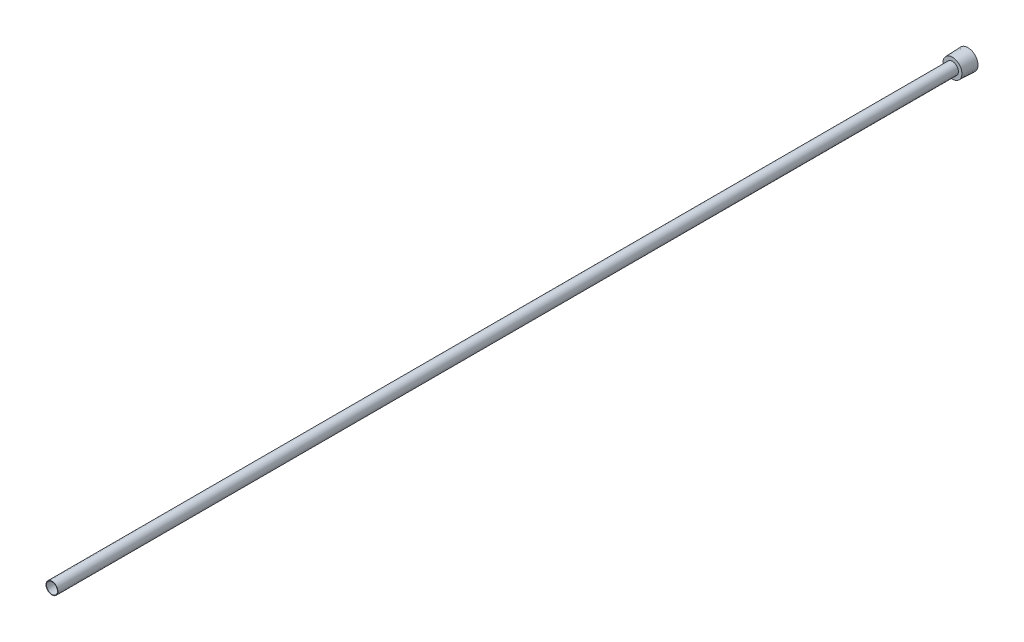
ISO-10303-21;
HEADER;
FILE_DESCRIPTION(('STEP AP214'),'2;1');
FILE_NAME('part.step','',(''),(''),'','','');
FILE_SCHEMA(('AUTOMOTIVE_DESIGN { 1 0 10303 214 1 1 1 1 }'));
ENDSEC;
DATA;
#1=APPLICATION_CONTEXT('core data for automotive mechanical design processes');
#2=APPLICATION_PROTOCOL_DEFINITION('international standard','automotive_design',2000,#1);
#3=PRODUCT_CONTEXT('',#1,'mechanical');
#4=PRODUCT('Part','Part','',(#3));
#5=PRODUCT_RELATED_PRODUCT_CATEGORY('part','',(#4));
#6=PRODUCT_DEFINITION_FORMATION('','',#4);
#7=PRODUCT_DEFINITION_CONTEXT('part definition',#1,'design');
#8=PRODUCT_DEFINITION('design','',#6,#7);
#9=PRODUCT_DEFINITION_SHAPE('','',#8);
#10=(LENGTH_UNIT() NAMED_UNIT(*) SI_UNIT(.MILLI.,.METRE.));
#11=(NAMED_UNIT(*) PLANE_ANGLE_UNIT() SI_UNIT($,.RADIAN.));
#12=(NAMED_UNIT(*) SI_UNIT($,.STERADIAN.) SOLID_ANGLE_UNIT());
#13=UNCERTAINTY_MEASURE_WITH_UNIT(LENGTH_MEASURE(1.E-05),#10,'distance_accuracy_value','');
#14=(GEOMETRIC_REPRESENTATION_CONTEXT(3) GLOBAL_UNCERTAINTY_ASSIGNED_CONTEXT((#13)) GLOBAL_UNIT_ASSIGNED_CONTEXT((#10,
#11,#12)) REPRESENTATION_CONTEXT('',''));
#15=CARTESIAN_POINT('',(0.,0.,0.));
#16=DIRECTION('',(0.,0.,1.));
#17=DIRECTION('',(1.,0.,0.));
#18=AXIS2_PLACEMENT_3D('',#15,#16,#17);
#19=CARTESIAN_POINT('',(0.,0.,0.));
#20=DIRECTION('',(0.,0.,1.));
#21=DIRECTION('',(1.,0.,0.));
#22=AXIS2_PLACEMENT_3D('',#19,#20,#21);
#23=CYLINDRICAL_SURFACE('',#22,3.65125);
#24=CARTESIAN_POINT('',(0.,0.,609.6));
#25=DIRECTION('',(0.,0.,1.));
#26=DIRECTION('',(1.,0.,0.));
#27=AXIS2_PLACEMENT_3D('',#24,#25,#26);
#28=CIRCLE('',#27,3.65125);
#29=CARTESIAN_POINT('',(3.65125,0.,609.6));
#30=VERTEX_POINT('',#29);
#31=EDGE_CURVE('E141',#30,#30,#28,.T.);
#32=CARTESIAN_POINT('',(0.,0.,6.35));
#33=DIRECTION('',(0.,0.,-1.));
#34=DIRECTION('',(-1.,0.,0.));
#35=AXIS2_PLACEMENT_3D('',#32,#33,#34);
#36=CIRCLE('',#35,3.65125);
#37=CARTESIAN_POINT('',(3.65125,0.,6.35));
#38=VERTEX_POINT('',#37);
#39=EDGE_CURVE('E36',#38,#38,#36,.F.);
#40=CARTESIAN_POINT('',(3.65125,0.,609.6));
#41=CARTESIAN_POINT('',(3.65125,0.,603.316145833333));
#42=CARTESIAN_POINT('',(3.65125,0.,597.032291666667));
#43=CARTESIAN_POINT('',(3.65125,0.,584.464583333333));
#44=CARTESIAN_POINT('',(3.65125,0.,578.180729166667));
#45=CARTESIAN_POINT('',(3.65125,0.,565.613020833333));
#46=CARTESIAN_POINT('',(3.65125,0.,559.329166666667));
#47=CARTESIAN_POINT('',(3.65125,0.,546.761458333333));
#48=CARTESIAN_POINT('',(3.65125,0.,540.477604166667));
#49=CARTESIAN_POINT('',(3.65125,0.,527.909895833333));
#50=CARTESIAN_POINT('',(3.65125,0.,521.626041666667));
#51=CARTESIAN_POINT('',(3.65125,0.,509.058333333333));
#52=CARTESIAN_POINT('',(3.65125,0.,502.774479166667));
#53=CARTESIAN_POINT('',(3.65125,0.,490.206770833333));
#54=CARTESIAN_POINT('',(3.65125,0.,483.922916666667));
#55=CARTESIAN_POINT('',(3.65125,0.,471.355208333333));
#56=CARTESIAN_POINT('',(3.65125,0.,465.071354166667));
#57=CARTESIAN_POINT('',(3.65125,0.,452.503645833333));
#58=CARTESIAN_POINT('',(3.65125,0.,446.219791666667));
#59=CARTESIAN_POINT('',(3.65125,0.,433.652083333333));
#60=CARTESIAN_POINT('',(3.65125,0.,427.368229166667));
#61=CARTESIAN_POINT('',(3.65125,0.,414.800520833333));
#62=CARTESIAN_POINT('',(3.65125,0.,408.516666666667));
#63=CARTESIAN_POINT('',(3.65125,0.,395.948958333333));
#64=CARTESIAN_POINT('',(3.65125,0.,389.665104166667));
#65=CARTESIAN_POINT('',(3.65125,0.,377.097395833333));
#66=CARTESIAN_POINT('',(3.65125,0.,370.813541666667));
#67=CARTESIAN_POINT('',(3.65125,0.,358.245833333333));
#68=CARTESIAN_POINT('',(3.65125,0.,351.961979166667));
#69=CARTESIAN_POINT('',(3.65125,0.,339.394270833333));
#70=CARTESIAN_POINT('',(3.65125,0.,333.110416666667));
#71=CARTESIAN_POINT('',(3.65125,0.,320.542708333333));
#72=CARTESIAN_POINT('',(3.65125,0.,314.258854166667));
#73=CARTESIAN_POINT('',(3.65125,0.,301.691145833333));
#74=CARTESIAN_POINT('',(3.65125,0.,295.407291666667));
#75=CARTESIAN_POINT('',(3.65125,0.,282.839583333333));
#76=CARTESIAN_POINT('',(3.65125,0.,276.555729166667));
#77=CARTESIAN_POINT('',(3.65125,0.,263.988020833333));
#78=CARTESIAN_POINT('',(3.65125,0.,257.704166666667));
#79=CARTESIAN_POINT('',(3.65125,0.,245.136458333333));
#80=CARTESIAN_POINT('',(3.65125,0.,238.852604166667));
#81=CARTESIAN_POINT('',(3.65125,0.,226.284895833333));
#82=CARTESIAN_POINT('',(3.65125,0.,220.001041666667));
#83=CARTESIAN_POINT('',(3.65125,0.,207.433333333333));
#84=CARTESIAN_POINT('',(3.65125,0.,201.149479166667));
#85=CARTESIAN_POINT('',(3.65125,0.,188.581770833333));
#86=CARTESIAN_POINT('',(3.65125,0.,182.297916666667));
#87=CARTESIAN_POINT('',(3.65125,0.,169.730208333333));
#88=CARTESIAN_POINT('',(3.65125,0.,163.446354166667));
#89=CARTESIAN_POINT('',(3.65125,0.,150.878645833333));
#90=CARTESIAN_POINT('',(3.65125,0.,144.594791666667));
#91=CARTESIAN_POINT('',(3.65125,0.,132.027083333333));
#92=CARTESIAN_POINT('',(3.65125,0.,125.743229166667));
#93=CARTESIAN_POINT('',(3.65125,0.,113.175520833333));
#94=CARTESIAN_POINT('',(3.65125,0.,106.891666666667));
#95=CARTESIAN_POINT('',(3.65125,0.,94.3239583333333));
#96=CARTESIAN_POINT('',(3.65125,0.,88.0401041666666));
#97=CARTESIAN_POINT('',(3.65125,0.,75.4723958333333));
#98=CARTESIAN_POINT('',(3.65125,0.,69.1885416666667));
#99=CARTESIAN_POINT('',(3.65125,0.,56.6208333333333));
#100=CARTESIAN_POINT('',(3.65125,0.,50.3369791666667));
#101=CARTESIAN_POINT('',(3.65125,0.,37.7692708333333));
#102=CARTESIAN_POINT('',(3.65125,0.,31.4854166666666));
#103=CARTESIAN_POINT('',(3.65125,0.,18.9177083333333));
#104=CARTESIAN_POINT('',(3.65125,0.,12.6338541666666));
#105=CARTESIAN_POINT('',(3.65125,0.,6.34999999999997));
#106=B_SPLINE_CURVE_WITH_KNOTS('',3,(#40,#41,#42,#43,#44,#45,#46,#47,#48,#49,#50,#51,#52,#53,
#54,#55,#56,#57,#58,#59,#60,#61,#62,#63,#64,#65,#66,#67,#68,#69,#70,#71,#72,#73,#74,#75,#76,#77,
#78,#79,#80,#81,#82,#83,#84,#85,#86,#87,#88,#89,#90,#91,#92,#93,#94,#95,#96,#97,#98,#99,#100,
#101,#102,#103,#104,#105),.UNSPECIFIED.,.F.,.F.,(4,2,2,2,2,2,2,2,2,2,2,2,2,2,2,2,2,2,2,2,2,2,2,
2,2,2,2,2,2,2,2,2,4),(0.,18.8515625,37.7031250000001,56.5546875,75.40625,94.2578125,113.109375,
131.9609375,150.8125,169.6640625,188.515625,207.3671875,226.21875,245.0703125,263.921875,
282.7734375,301.625,320.4765625,339.328125,358.1796875,377.03125,395.8828125,414.734375,
433.5859375,452.4375,471.2890625,490.140625,508.9921875,527.84375,546.6953125,565.546875,
584.3984375,603.25),.UNSPECIFIED.);
#107=EDGE_CURVE('BSEAM32',#30,#38,#106,.T.);
#108=ORIENTED_EDGE('',*,*,#31,.T.);
#109=ORIENTED_EDGE('',*,*,#39,.F.);
#110=ORIENTED_EDGE('',*,*,#107,.T.);
#111=ORIENTED_EDGE('',*,*,#107,.F.);
#112=EDGE_LOOP('',(#108,#110,#109,#111));
#113=FACE_BOUND('',#112,.T.);
#114=ADVANCED_FACE('F32',(#113),#23,.F.);
#115=CARTESIAN_POINT('',(0.,0.,0.));
#116=DIRECTION('',(0.,0.,-1.));
#117=DIRECTION('',(-1.,0.,0.));
#118=AXIS2_PLACEMENT_3D('',#115,#116,#117);
#119=CONICAL_SURFACE('',#118,6.7183,0.0364599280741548);
#120=CARTESIAN_POINT('',(0.,0.,10.3124));
#121=DIRECTION('',(0.,0.,1.));
#122=DIRECTION('',(1.,0.,0.));
#123=AXIS2_PLACEMENT_3D('',#120,#121,#122);
#124=CIRCLE('',#123,6.34214394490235);
#125=CARTESIAN_POINT('',(6.34214394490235,0.,10.3124));
#126=VERTEX_POINT('',#125);
#127=EDGE_CURVE('E11',#126,#126,#124,.T.);
#128=ORIENTED_EDGE('',*,*,#127,.F.);
#129=EDGE_LOOP('',(#128));
#130=FACE_BOUND('',#129,.T.);
#131=CARTESIAN_POINT('',(0.,0.,0.));
#132=DIRECTION('',(0.,0.,1.));
#133=DIRECTION('',(1.,0.,0.));
#134=AXIS2_PLACEMENT_3D('',#131,#132,#133);
#135=CIRCLE('',#134,6.7183);
#136=CARTESIAN_POINT('',(6.7183,0.,0.));
#137=VERTEX_POINT('',#136);
#138=EDGE_CURVE('E144',#137,#137,#135,.T.);
#139=ORIENTED_EDGE('',*,*,#138,.T.);
#140=EDGE_LOOP('',(#139));
#141=FACE_BOUND('',#140,.T.);
#142=ADVANCED_FACE('F34',(#130,#141),#119,.T.);
#143=CARTESIAN_POINT('',(0.,6.34214394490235,10.3124));
#144=DIRECTION('',(0.,0.,-1.));
#145=DIRECTION('',(-1.,0.,0.));
#146=AXIS2_PLACEMENT_3D('',#143,#144,#145);
#147=PLANE('',#146);
#148=CARTESIAN_POINT('',(0.,0.,10.3124));
#149=DIRECTION('',(0.,0.,1.));
#150=DIRECTION('',(1.,0.,0.));
#151=AXIS2_PLACEMENT_3D('',#148,#149,#150);
#152=CIRCLE('',#151,3.96875);
#153=CARTESIAN_POINT('',(3.96875,0.,10.3124));
#154=VERTEX_POINT('',#153);
#155=EDGE_CURVE('E41',#154,#154,#152,.T.);
#156=ORIENTED_EDGE('',*,*,#155,.F.);
#157=EDGE_LOOP('',(#156));
#158=FACE_BOUND('',#157,.T.);
#159=ORIENTED_EDGE('',*,*,#127,.T.);
#160=EDGE_LOOP('',(#159));
#161=FACE_BOUND('',#160,.T.);
#162=ADVANCED_FACE('F155',(#158,#161),#147,.F.);
#163=CARTESIAN_POINT('',(0.,0.,331.124179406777));
#164=DIRECTION('',(0.,0.,1.));
#165=DIRECTION('',(1.,0.,0.));
#166=AXIS2_PLACEMENT_3D('',#163,#164,#165);
#167=CYLINDRICAL_SURFACE('',#166,3.96874999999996);
#168=CARTESIAN_POINT('',(0.,0.,609.6));
#169=DIRECTION('',(0.,0.,1.));
#170=DIRECTION('',(1.,0.,0.));
#171=AXIS2_PLACEMENT_3D('',#168,#169,#170);
#172=CIRCLE('',#171,3.96874999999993);
#173=CARTESIAN_POINT('',(3.96874999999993,0.,609.6));
#174=VERTEX_POINT('',#173);
#175=EDGE_CURVE('E147',#174,#174,#172,.T.);
#176=ORIENTED_EDGE('',*,*,#175,.F.);
#177=EDGE_LOOP('',(#176));
#178=FACE_BOUND('',#177,.T.);
#179=ORIENTED_EDGE('',*,*,#155,.T.);
#180=EDGE_LOOP('',(#179));
#181=FACE_BOUND('',#180,.T.);
#182=ADVANCED_FACE('F153',(#178,#181),#167,.T.);
#183=CARTESIAN_POINT('',(0.,3.96874999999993,609.6));
#184=DIRECTION('',(0.,0.,-1.));
#185=DIRECTION('',(-1.,0.,0.));
#186=AXIS2_PLACEMENT_3D('',#183,#184,#185);
#187=PLANE('',#186);
#188=ORIENTED_EDGE('',*,*,#31,.F.);
#189=EDGE_LOOP('',(#188));
#190=FACE_BOUND('',#189,.T.);
#191=ORIENTED_EDGE('',*,*,#175,.T.);
#192=EDGE_LOOP('',(#191));
#193=FACE_BOUND('',#192,.T.);
#194=ADVANCED_FACE('F166',(#190,#193),#187,.F.);
#195=CARTESIAN_POINT('',(0.,0.,0.));
#196=DIRECTION('',(0.,0.,1.));
#197=DIRECTION('',(1.,0.,0.));
#198=AXIS2_PLACEMENT_3D('',#195,#196,#197);
#199=PLANE('',#198);
#200=DIRECTION('',(-0.866025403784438,-0.5,0.));
#201=VECTOR('',#200,1.);
#202=CARTESIAN_POINT('',(4.7625,-2.74963065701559,0.));
#203=LINE('',#202,#201);
#204=CARTESIAN_POINT('',(4.7625,-2.74963065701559,0.));
#205=VERTEX_POINT('',#204);
#206=CARTESIAN_POINT('',(0.,-5.49926131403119,0.));
#207=VERTEX_POINT('',#206);
#208=EDGE_CURVE('E123',#205,#207,#203,.T.);
#209=ORIENTED_EDGE('',*,*,#208,.F.);
#210=DIRECTION('',(0.,-1.,0.));
#211=VECTOR('',#210,1.);
#212=CARTESIAN_POINT('',(4.7625,2.74963065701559,0.));
#213=LINE('',#212,#211);
#214=CARTESIAN_POINT('',(4.7625,2.74963065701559,0.));
#215=VERTEX_POINT('',#214);
#216=EDGE_CURVE('E48',#215,#205,#213,.T.);
#217=ORIENTED_EDGE('',*,*,#216,.F.);
#218=DIRECTION('',(0.866025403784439,-0.5,0.));
#219=VECTOR('',#218,1.);
#220=CARTESIAN_POINT('',(0.,5.49926131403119,0.));
#221=LINE('',#220,#219);
#222=CARTESIAN_POINT('',(0.,5.49926131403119,0.));
#223=VERTEX_POINT('',#222);
#224=EDGE_CURVE('E132',#223,#215,#221,.T.);
#225=ORIENTED_EDGE('',*,*,#224,.F.);
#226=DIRECTION('',(0.866025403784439,0.5,0.));
#227=VECTOR('',#226,1.);
#228=CARTESIAN_POINT('',(-4.7625,2.7496306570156,0.));
#229=LINE('',#228,#227);
#230=CARTESIAN_POINT('',(-4.7625,2.7496306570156,0.));
#231=VERTEX_POINT('',#230);
#232=EDGE_CURVE('E130',#231,#223,#229,.T.);
#233=ORIENTED_EDGE('',*,*,#232,.F.);
#234=DIRECTION('',(0.,1.,0.));
#235=VECTOR('',#234,1.);
#236=CARTESIAN_POINT('',(-4.7625,-2.74963065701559,0.));
#237=LINE('',#236,#235);
#238=CARTESIAN_POINT('',(-4.7625,-2.74963065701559,0.));
#239=VERTEX_POINT('',#238);
#240=EDGE_CURVE('E96',#239,#231,#237,.T.);
#241=ORIENTED_EDGE('',*,*,#240,.F.);
#242=DIRECTION('',(-0.866025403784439,0.5,0.));
#243=VECTOR('',#242,1.);
#244=CARTESIAN_POINT('',(0.,-5.49926131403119,0.));
#245=LINE('',#244,#243);
#246=EDGE_CURVE('E126',#207,#239,#245,.T.);
#247=ORIENTED_EDGE('',*,*,#246,.F.);
#248=EDGE_LOOP('',(#209,#217,#225,#233,#241,#247));
#249=FACE_BOUND('',#248,.T.);
#250=ORIENTED_EDGE('',*,*,#138,.F.);
#251=EDGE_LOOP('',(#250));
#252=FACE_BOUND('',#251,.T.);
#253=ADVANCED_FACE('F164',(#249,#252),#199,.F.);
#254=CARTESIAN_POINT('',(4.7625,-2.74963065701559,6.35));
#255=DIRECTION('',(0.,0.,-1.));
#256=DIRECTION('',(-1.,0.,0.));
#257=AXIS2_PLACEMENT_3D('',#254,#255,#256);
#258=PLANE('',#257);
#259=DIRECTION('',(0.,-1.,0.));
#260=VECTOR('',#259,1.);
#261=CARTESIAN_POINT('',(4.7625,2.74963065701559,6.35));
#262=LINE('',#261,#260);
#263=CARTESIAN_POINT('',(4.7625,2.74963065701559,6.35));
#264=VERTEX_POINT('',#263);
#265=CARTESIAN_POINT('',(4.7625,-2.74963065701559,6.35));
#266=VERTEX_POINT('',#265);
#267=EDGE_CURVE('E134',#264,#266,#262,.T.);
#268=ORIENTED_EDGE('',*,*,#267,.T.);
#269=DIRECTION('',(-0.866025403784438,-0.5,0.));
#270=VECTOR('',#269,1.);
#271=CARTESIAN_POINT('',(4.7625,-2.74963065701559,6.35));
#272=LINE('',#271,#270);
#273=CARTESIAN_POINT('',(0.,-5.49926131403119,6.35));
#274=VERTEX_POINT('',#273);
#275=EDGE_CURVE('E117',#266,#274,#272,.T.);
#276=ORIENTED_EDGE('',*,*,#275,.T.);
#277=DIRECTION('',(-0.866025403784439,0.5,0.));
#278=VECTOR('',#277,1.);
#279=CARTESIAN_POINT('',(0.,-5.49926131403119,6.35));
#280=LINE('',#279,#278);
#281=CARTESIAN_POINT('',(-4.7625,-2.74963065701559,6.35));
#282=VERTEX_POINT('',#281);
#283=EDGE_CURVE('E115',#274,#282,#280,.T.);
#284=ORIENTED_EDGE('',*,*,#283,.T.);
#285=DIRECTION('',(0.,1.,0.));
#286=VECTOR('',#285,1.);
#287=CARTESIAN_POINT('',(-4.7625,-2.74963065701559,6.35));
#288=LINE('',#287,#286);
#289=CARTESIAN_POINT('',(-4.7625,2.7496306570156,6.35));
#290=VERTEX_POINT('',#289);
#291=EDGE_CURVE('E93',#282,#290,#288,.T.);
#292=ORIENTED_EDGE('',*,*,#291,.T.);
#293=DIRECTION('',(0.866025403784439,0.5,0.));
#294=VECTOR('',#293,1.);
#295=CARTESIAN_POINT('',(-4.7625,2.7496306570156,6.35));
#296=LINE('',#295,#294);
#297=CARTESIAN_POINT('',(0.,5.49926131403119,6.35));
#298=VERTEX_POINT('',#297);
#299=EDGE_CURVE('E104',#290,#298,#296,.T.);
#300=ORIENTED_EDGE('',*,*,#299,.T.);
#301=DIRECTION('',(0.866025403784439,-0.5,0.));
#302=VECTOR('',#301,1.);
#303=CARTESIAN_POINT('',(0.,5.49926131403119,6.35));
#304=LINE('',#303,#302);
#305=EDGE_CURVE('E108',#298,#264,#304,.T.);
#306=ORIENTED_EDGE('',*,*,#305,.T.);
#307=EDGE_LOOP('',(#268,#276,#284,#292,#300,#306));
#308=FACE_BOUND('',#307,.T.);
#309=ORIENTED_EDGE('',*,*,#39,.T.);
#310=EDGE_LOOP('',(#309));
#311=FACE_BOUND('',#310,.T.);
#312=ADVANCED_FACE('F111',(#308,#311),#258,.T.);
#313=CARTESIAN_POINT('',(4.7625,2.74963065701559,6.35));
#314=DIRECTION('',(1.,0.,0.));
#315=DIRECTION('',(0.,1.,0.));
#316=AXIS2_PLACEMENT_3D('',#313,#314,#315);
#317=PLANE('',#316);
#318=ORIENTED_EDGE('',*,*,#216,.T.);
#319=DIRECTION('',(0.,0.,-1.));
#320=VECTOR('',#319,1.);
#321=CARTESIAN_POINT('',(4.7625,-2.74963065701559,6.35));
#322=LINE('',#321,#320);
#323=EDGE_CURVE('E78',#266,#205,#322,.T.);
#324=ORIENTED_EDGE('',*,*,#323,.F.);
#325=ORIENTED_EDGE('',*,*,#267,.F.);
#326=DIRECTION('',(0.,0.,-1.));
#327=VECTOR('',#326,1.);
#328=CARTESIAN_POINT('',(4.7625,2.74963065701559,6.35));
#329=LINE('',#328,#327);
#330=EDGE_CURVE('E56',#264,#215,#329,.T.);
#331=ORIENTED_EDGE('',*,*,#330,.T.);
#332=EDGE_LOOP('',(#318,#324,#325,#331));
#333=FACE_BOUND('',#332,.T.);
#334=ADVANCED_FACE('F173',(#333),#317,.F.);
#335=CARTESIAN_POINT('',(0.,5.49926131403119,6.35));
#336=DIRECTION('',(0.5,0.866025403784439,0.));
#337=DIRECTION('',(-0.866025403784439,0.5,0.));
#338=AXIS2_PLACEMENT_3D('',#335,#336,#337);
#339=PLANE('',#338);
#340=ORIENTED_EDGE('',*,*,#224,.T.);
#341=ORIENTED_EDGE('',*,*,#330,.F.);
#342=ORIENTED_EDGE('',*,*,#305,.F.);
#343=DIRECTION('',(0.,0.,-1.));
#344=VECTOR('',#343,1.);
#345=CARTESIAN_POINT('',(0.,5.49926131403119,6.35));
#346=LINE('',#345,#344);
#347=EDGE_CURVE('E100',#298,#223,#346,.T.);
#348=ORIENTED_EDGE('',*,*,#347,.T.);
#349=EDGE_LOOP('',(#340,#341,#342,#348));
#350=FACE_BOUND('',#349,.T.);
#351=ADVANCED_FACE('F187',(#350),#339,.F.);
#352=CARTESIAN_POINT('',(-4.7625,2.7496306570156,6.35));
#353=DIRECTION('',(-0.5,0.866025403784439,0.));
#354=DIRECTION('',(-0.866025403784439,-0.5,0.));
#355=AXIS2_PLACEMENT_3D('',#352,#353,#354);
#356=PLANE('',#355);
#357=ORIENTED_EDGE('',*,*,#232,.T.);
#358=ORIENTED_EDGE('',*,*,#347,.F.);
#359=ORIENTED_EDGE('',*,*,#299,.F.);
#360=DIRECTION('',(0.,0.,-1.));
#361=VECTOR('',#360,1.);
#362=CARTESIAN_POINT('',(-4.7625,2.7496306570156,6.35));
#363=LINE('',#362,#361);
#364=EDGE_CURVE('E89',#290,#231,#363,.T.);
#365=ORIENTED_EDGE('',*,*,#364,.T.);
#366=EDGE_LOOP('',(#357,#358,#359,#365));
#367=FACE_BOUND('',#366,.T.);
#368=ADVANCED_FACE('F105',(#367),#356,.F.);
#369=CARTESIAN_POINT('',(-4.7625,-2.74963065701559,6.35));
#370=DIRECTION('',(-1.,0.,0.));
#371=DIRECTION('',(0.,0.,1.));
#372=AXIS2_PLACEMENT_3D('',#369,#370,#371);
#373=PLANE('',#372);
#374=ORIENTED_EDGE('',*,*,#240,.T.);
#375=ORIENTED_EDGE('',*,*,#364,.F.);
#376=ORIENTED_EDGE('',*,*,#291,.F.);
#377=DIRECTION('',(0.,0.,-1.));
#378=VECTOR('',#377,1.);
#379=CARTESIAN_POINT('',(-4.7625,-2.74963065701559,6.35));
#380=LINE('',#379,#378);
#381=EDGE_CURVE('E101',#282,#239,#380,.T.);
#382=ORIENTED_EDGE('',*,*,#381,.T.);
#383=EDGE_LOOP('',(#374,#375,#376,#382));
#384=FACE_BOUND('',#383,.T.);
#385=ADVANCED_FACE('F91',(#384),#373,.F.);
#386=CARTESIAN_POINT('',(0.,-5.49926131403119,6.35));
#387=DIRECTION('',(-0.5,-0.866025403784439,0.));
#388=DIRECTION('',(0.866025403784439,-0.5,0.));
#389=AXIS2_PLACEMENT_3D('',#386,#387,#388);
#390=PLANE('',#389);
#391=ORIENTED_EDGE('',*,*,#246,.T.);
#392=ORIENTED_EDGE('',*,*,#381,.F.);
#393=ORIENTED_EDGE('',*,*,#283,.F.);
#394=DIRECTION('',(0.,0.,-1.));
#395=VECTOR('',#394,1.);
#396=CARTESIAN_POINT('',(0.,-5.49926131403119,6.35));
#397=LINE('',#396,#395);
#398=EDGE_CURVE('E138',#274,#207,#397,.T.);
#399=ORIENTED_EDGE('',*,*,#398,.T.);
#400=EDGE_LOOP('',(#391,#392,#393,#399));
#401=FACE_BOUND('',#400,.T.);
#402=ADVANCED_FACE('F191',(#401),#390,.F.);
#403=CARTESIAN_POINT('',(4.7625,-2.74963065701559,6.35));
#404=DIRECTION('',(0.5,-0.866025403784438,0.));
#405=DIRECTION('',(0.866025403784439,0.5,0.));
#406=AXIS2_PLACEMENT_3D('',#403,#404,#405);
#407=PLANE('',#406);
#408=ORIENTED_EDGE('',*,*,#208,.T.);
#409=ORIENTED_EDGE('',*,*,#398,.F.);
#410=ORIENTED_EDGE('',*,*,#275,.F.);
#411=ORIENTED_EDGE('',*,*,#323,.T.);
#412=EDGE_LOOP('',(#408,#409,#410,#411));
#413=FACE_BOUND('',#412,.T.);
#414=ADVANCED_FACE('F188',(#413),#407,.F.);
#415=CLOSED_SHELL('',(#114,#142,#162,#182,#194,#253,#312,#334,#351,#368,#385,#402,#414));
#416=MANIFOLD_SOLID_BREP('B2',#415);
#417=ADVANCED_BREP_SHAPE_REPRESENTATION('',(#18,#416),#14);
#418=SHAPE_DEFINITION_REPRESENTATION(#9,#417);
ENDSEC;
END-ISO-10303-21;
